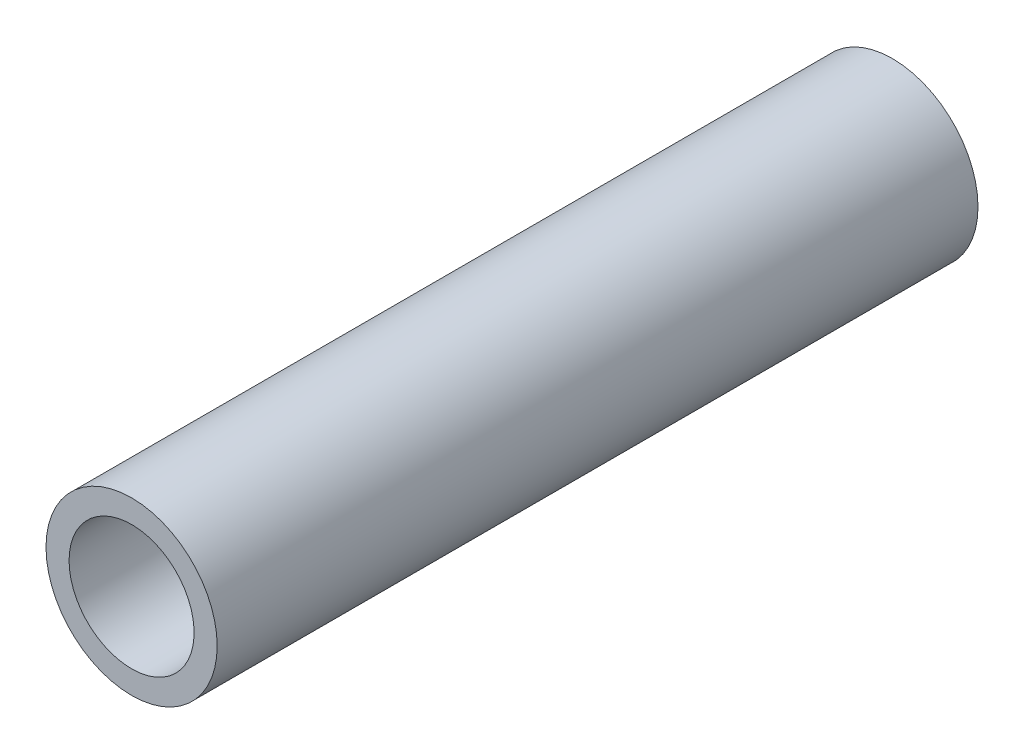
from build123d import *

# Parameters (mm, degrees)
SKETCH1_R      = 8.5725
SKETCH1_R_2    = 6.2611
EXTRUDE1_DEPTH = 76.2


with BuildPart() as part:
    # Sketch1 → Extrude1 (new body)
    with BuildSketch(Plane.XY):
        with Locations(Location((0, 0, 0), (0, 0, 180))):
            Circle(SKETCH1_R)
        with Locations(Location((0, 0, 0), (0, 0, 180))):
            Circle(SKETCH1_R_2, mode=Mode.SUBTRACT)
    extrude(amount=EXTRUDE1_DEPTH)


solid = part.part
